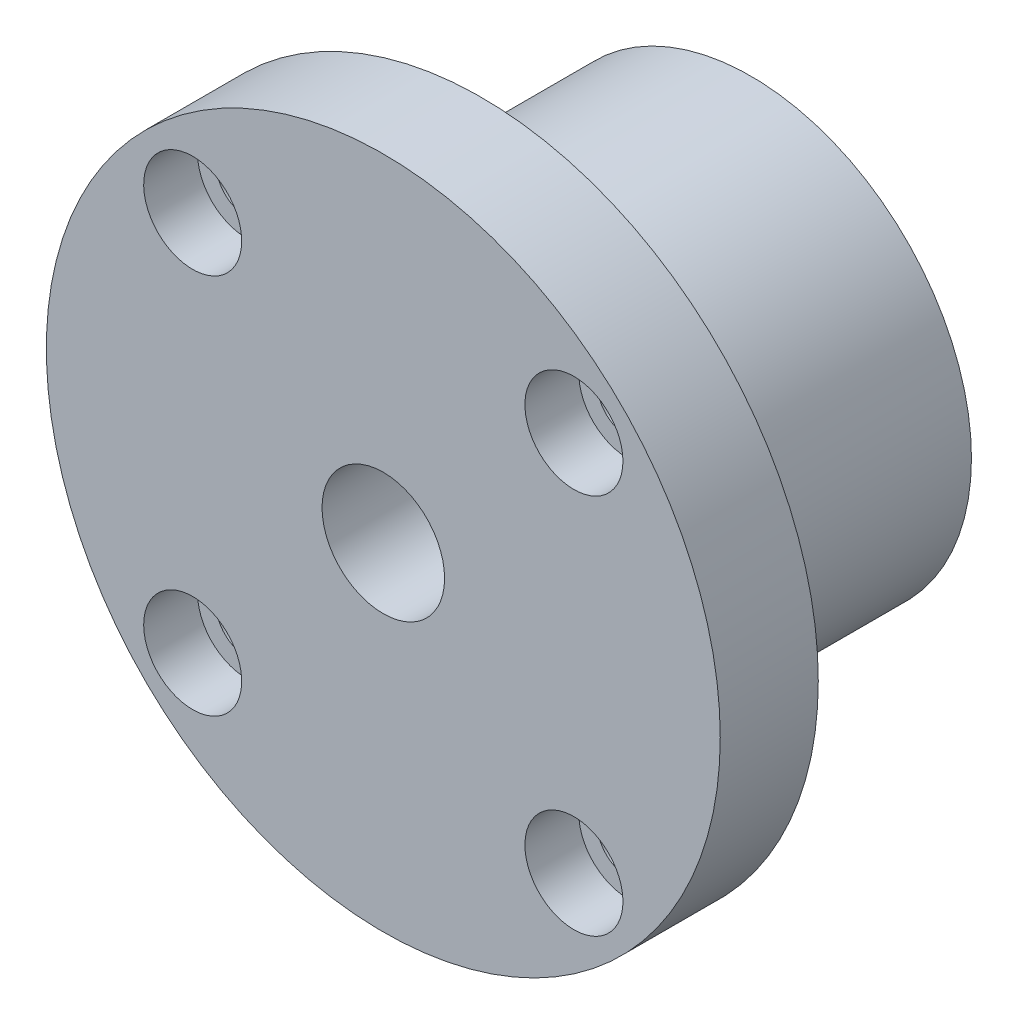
ISO-10303-21;
HEADER;
FILE_DESCRIPTION(('STEP AP214'),'2;1');
FILE_NAME('part.step','',(''),(''),'','','');
FILE_SCHEMA(('AUTOMOTIVE_DESIGN { 1 0 10303 214 1 1 1 1 }'));
ENDSEC;
DATA;
#1=APPLICATION_CONTEXT('core data for automotive mechanical design processes');
#2=APPLICATION_PROTOCOL_DEFINITION('international standard','automotive_design',2000,#1);
#3=PRODUCT_CONTEXT('',#1,'mechanical');
#4=PRODUCT('Part','Part','',(#3));
#5=PRODUCT_RELATED_PRODUCT_CATEGORY('part','',(#4));
#6=PRODUCT_DEFINITION_FORMATION('','',#4);
#7=PRODUCT_DEFINITION_CONTEXT('part definition',#1,'design');
#8=PRODUCT_DEFINITION('design','',#6,#7);
#9=PRODUCT_DEFINITION_SHAPE('','',#8);
#10=(LENGTH_UNIT() NAMED_UNIT(*) SI_UNIT(.MILLI.,.METRE.));
#11=(NAMED_UNIT(*) PLANE_ANGLE_UNIT() SI_UNIT($,.RADIAN.));
#12=(NAMED_UNIT(*) SI_UNIT($,.STERADIAN.) SOLID_ANGLE_UNIT());
#13=UNCERTAINTY_MEASURE_WITH_UNIT(LENGTH_MEASURE(1.E-05),#10,'distance_accuracy_value','');
#14=(GEOMETRIC_REPRESENTATION_CONTEXT(3) GLOBAL_UNCERTAINTY_ASSIGNED_CONTEXT((#13)) GLOBAL_UNIT_ASSIGNED_CONTEXT((#10,
#11,#12)) REPRESENTATION_CONTEXT('',''));
#15=CARTESIAN_POINT('',(0.,0.,0.));
#16=DIRECTION('',(0.,0.,1.));
#17=DIRECTION('',(1.,0.,0.));
#18=AXIS2_PLACEMENT_3D('',#15,#16,#17);
#19=CARTESIAN_POINT('',(0.,0.,0.));
#20=DIRECTION('',(0.,0.,1.));
#21=DIRECTION('',(1.,0.,0.));
#22=AXIS2_PLACEMENT_3D('',#19,#20,#21);
#23=PLANE('',#22);
#24=CARTESIAN_POINT('',(0.,0.,0.));
#25=DIRECTION('',(0.,0.,1.));
#26=DIRECTION('',(1.,0.,0.));
#27=AXIS2_PLACEMENT_3D('',#24,#25,#26);
#28=CIRCLE('',#27,27.5);
#29=CARTESIAN_POINT('',(27.5,0.,0.));
#30=VERTEX_POINT('',#29);
#31=EDGE_CURVE('E25',#30,#30,#28,.T.);
#32=ORIENTED_EDGE('',*,*,#31,.F.);
#33=EDGE_LOOP('',(#32));
#34=FACE_BOUND('',#33,.T.);
#35=CARTESIAN_POINT('',(15.556349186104,15.5563491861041,0.));
#36=DIRECTION('',(0.,0.,1.));
#37=DIRECTION('',(1.,0.,0.));
#38=AXIS2_PLACEMENT_3D('',#35,#36,#37);
#39=CIRCLE('',#38,2.5);
#40=CARTESIAN_POINT('',(18.056349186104,15.5563491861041,0.));
#41=VERTEX_POINT('',#40);
#42=EDGE_CURVE('E67',#41,#41,#39,.T.);
#43=ORIENTED_EDGE('',*,*,#42,.T.);
#44=EDGE_LOOP('',(#43));
#45=FACE_BOUND('',#44,.T.);
#46=CARTESIAN_POINT('',(15.556349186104,-15.556349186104,0.));
#47=DIRECTION('',(0.,0.,1.));
#48=DIRECTION('',(0.,-1.,0.));
#49=AXIS2_PLACEMENT_3D('',#46,#47,#48);
#50=CIRCLE('',#49,2.5);
#51=CARTESIAN_POINT('',(15.556349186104,-18.056349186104,0.));
#52=VERTEX_POINT('',#51);
#53=EDGE_CURVE('E57',#52,#52,#50,.T.);
#54=ORIENTED_EDGE('',*,*,#53,.T.);
#55=EDGE_LOOP('',(#54));
#56=FACE_BOUND('',#55,.T.);
#57=CARTESIAN_POINT('',(-15.5563491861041,-15.556349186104,0.));
#58=DIRECTION('',(0.,0.,1.));
#59=DIRECTION('',(-1.,0.,0.));
#60=AXIS2_PLACEMENT_3D('',#57,#58,#59);
#61=CIRCLE('',#60,2.5);
#62=CARTESIAN_POINT('',(-18.0563491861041,-15.556349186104,0.));
#63=VERTEX_POINT('',#62);
#64=EDGE_CURVE('E54',#63,#63,#61,.T.);
#65=ORIENTED_EDGE('',*,*,#64,.T.);
#66=EDGE_LOOP('',(#65));
#67=FACE_BOUND('',#66,.T.);
#68=CARTESIAN_POINT('',(-15.556349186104,15.5563491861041,0.));
#69=DIRECTION('',(0.,0.,1.));
#70=DIRECTION('',(0.,1.,0.));
#71=AXIS2_PLACEMENT_3D('',#68,#69,#70);
#72=CIRCLE('',#71,2.5);
#73=CARTESIAN_POINT('',(-15.5563491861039,18.0563491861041,0.));
#74=VERTEX_POINT('',#73);
#75=EDGE_CURVE('E51',#74,#74,#72,.T.);
#76=ORIENTED_EDGE('',*,*,#75,.T.);
#77=EDGE_LOOP('',(#76));
#78=FACE_BOUND('',#77,.T.);
#79=CARTESIAN_POINT('',(0.,0.,0.));
#80=DIRECTION('',(0.,0.,1.));
#81=DIRECTION('',(1.,0.,0.));
#82=AXIS2_PLACEMENT_3D('',#79,#80,#81);
#83=CIRCLE('',#82,18.);
#84=CARTESIAN_POINT('',(18.,0.,0.));
#85=VERTEX_POINT('',#84);
#86=EDGE_CURVE('E8',#85,#85,#83,.F.);
#87=ORIENTED_EDGE('',*,*,#86,.F.);
#88=EDGE_LOOP('',(#87));
#89=FACE_BOUND('',#88,.T.);
#90=ADVANCED_FACE('F12',(#34,#45,#56,#67,#78,#89),#23,.F.);
#91=CARTESIAN_POINT('',(-15.556349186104,15.5563491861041,0.));
#92=DIRECTION('',(0.,0.,1.));
#93=DIRECTION('',(1.,0.,0.));
#94=AXIS2_PLACEMENT_3D('',#91,#92,#93);
#95=CYLINDRICAL_SURFACE('',#94,2.5);
#96=ORIENTED_EDGE('',*,*,#75,.F.);
#97=EDGE_LOOP('',(#96));
#98=FACE_BOUND('',#97,.T.);
#99=CARTESIAN_POINT('',(-15.556349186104,15.5563491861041,3.6));
#100=DIRECTION('',(0.,0.,1.));
#101=DIRECTION('',(1.,0.,0.));
#102=AXIS2_PLACEMENT_3D('',#99,#100,#101);
#103=CIRCLE('',#102,2.5);
#104=CARTESIAN_POINT('',(-13.056349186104,15.5563491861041,3.6));
#105=VERTEX_POINT('',#104);
#106=EDGE_CURVE('E16',#105,#105,#103,.F.);
#107=ORIENTED_EDGE('',*,*,#106,.F.);
#108=EDGE_LOOP('',(#107));
#109=FACE_BOUND('',#108,.T.);
#110=ADVANCED_FACE('F86',(#98,#109),#95,.F.);
#111=CARTESIAN_POINT('',(-15.5563491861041,-15.556349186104,0.));
#112=DIRECTION('',(0.,0.,1.));
#113=DIRECTION('',(1.,0.,0.));
#114=AXIS2_PLACEMENT_3D('',#111,#112,#113);
#115=CYLINDRICAL_SURFACE('',#114,2.5);
#116=ORIENTED_EDGE('',*,*,#64,.F.);
#117=EDGE_LOOP('',(#116));
#118=FACE_BOUND('',#117,.T.);
#119=CARTESIAN_POINT('',(-15.5563491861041,-15.556349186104,3.6));
#120=DIRECTION('',(0.,0.,1.));
#121=DIRECTION('',(1.,0.,0.));
#122=AXIS2_PLACEMENT_3D('',#119,#120,#121);
#123=CIRCLE('',#122,2.5);
#124=CARTESIAN_POINT('',(-13.0563491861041,-15.556349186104,3.6));
#125=VERTEX_POINT('',#124);
#126=EDGE_CURVE('E43',#125,#125,#123,.F.);
#127=ORIENTED_EDGE('',*,*,#126,.F.);
#128=EDGE_LOOP('',(#127));
#129=FACE_BOUND('',#128,.T.);
#130=ADVANCED_FACE('F83',(#118,#129),#115,.F.);
#131=CARTESIAN_POINT('',(15.556349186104,-15.556349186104,0.));
#132=DIRECTION('',(0.,0.,1.));
#133=DIRECTION('',(1.,0.,0.));
#134=AXIS2_PLACEMENT_3D('',#131,#132,#133);
#135=CYLINDRICAL_SURFACE('',#134,2.5);
#136=ORIENTED_EDGE('',*,*,#53,.F.);
#137=EDGE_LOOP('',(#136));
#138=FACE_BOUND('',#137,.T.);
#139=CARTESIAN_POINT('',(15.556349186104,-15.556349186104,3.6));
#140=DIRECTION('',(0.,0.,1.));
#141=DIRECTION('',(1.,0.,0.));
#142=AXIS2_PLACEMENT_3D('',#139,#140,#141);
#143=CIRCLE('',#142,2.5);
#144=CARTESIAN_POINT('',(18.056349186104,-15.556349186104,3.6));
#145=VERTEX_POINT('',#144);
#146=EDGE_CURVE('E50',#145,#145,#143,.F.);
#147=ORIENTED_EDGE('',*,*,#146,.F.);
#148=EDGE_LOOP('',(#147));
#149=FACE_BOUND('',#148,.T.);
#150=ADVANCED_FACE('F85',(#138,#149),#135,.F.);
#151=CARTESIAN_POINT('',(15.556349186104,15.5563491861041,0.));
#152=DIRECTION('',(0.,0.,1.));
#153=DIRECTION('',(1.,0.,0.));
#154=AXIS2_PLACEMENT_3D('',#151,#152,#153);
#155=CYLINDRICAL_SURFACE('',#154,2.5);
#156=ORIENTED_EDGE('',*,*,#42,.F.);
#157=EDGE_LOOP('',(#156));
#158=FACE_BOUND('',#157,.T.);
#159=CARTESIAN_POINT('',(15.556349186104,15.5563491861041,3.6));
#160=DIRECTION('',(0.,0.,1.));
#161=DIRECTION('',(1.,0.,0.));
#162=AXIS2_PLACEMENT_3D('',#159,#160,#161);
#163=CIRCLE('',#162,2.5);
#164=CARTESIAN_POINT('',(18.056349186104,15.5563491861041,3.6));
#165=VERTEX_POINT('',#164);
#166=EDGE_CURVE('E66',#165,#165,#163,.F.);
#167=ORIENTED_EDGE('',*,*,#166,.F.);
#168=EDGE_LOOP('',(#167));
#169=FACE_BOUND('',#168,.T.);
#170=ADVANCED_FACE('F94',(#158,#169),#155,.F.);
#171=CARTESIAN_POINT('',(0.,0.,8.));
#172=DIRECTION('',(0.,0.,1.));
#173=DIRECTION('',(1.,0.,0.));
#174=AXIS2_PLACEMENT_3D('',#171,#172,#173);
#175=PLANE('',#174);
#176=CARTESIAN_POINT('',(-15.5563491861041,-15.556349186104,8.));
#177=DIRECTION('',(0.,0.,1.));
#178=DIRECTION('',(-1.,0.,0.));
#179=AXIS2_PLACEMENT_3D('',#176,#177,#178);
#180=CIRCLE('',#179,4.);
#181=CARTESIAN_POINT('',(-19.5563491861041,-15.556349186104,8.));
#182=VERTEX_POINT('',#181);
#183=EDGE_CURVE('E37',#182,#182,#180,.T.);
#184=ORIENTED_EDGE('',*,*,#183,.F.);
#185=EDGE_LOOP('',(#184));
#186=FACE_BOUND('',#185,.T.);
#187=CARTESIAN_POINT('',(-15.556349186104,15.5563491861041,8.));
#188=DIRECTION('',(0.,0.,1.));
#189=DIRECTION('',(0.,1.,0.));
#190=AXIS2_PLACEMENT_3D('',#187,#188,#189);
#191=CIRCLE('',#190,4.);
#192=CARTESIAN_POINT('',(-15.5563491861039,19.5563491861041,8.));
#193=VERTEX_POINT('',#192);
#194=EDGE_CURVE('E31',#193,#193,#191,.T.);
#195=ORIENTED_EDGE('',*,*,#194,.F.);
#196=EDGE_LOOP('',(#195));
#197=FACE_BOUND('',#196,.T.);
#198=CARTESIAN_POINT('',(15.556349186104,15.5563491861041,8.));
#199=DIRECTION('',(0.,0.,1.));
#200=DIRECTION('',(1.,0.,0.));
#201=AXIS2_PLACEMENT_3D('',#198,#199,#200);
#202=CIRCLE('',#201,4.);
#203=CARTESIAN_POINT('',(19.556349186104,15.5563491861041,8.));
#204=VERTEX_POINT('',#203);
#205=EDGE_CURVE('E60',#204,#204,#202,.T.);
#206=ORIENTED_EDGE('',*,*,#205,.F.);
#207=EDGE_LOOP('',(#206));
#208=FACE_BOUND('',#207,.T.);
#209=CARTESIAN_POINT('',(15.556349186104,-15.556349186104,8.));
#210=DIRECTION('',(0.,0.,1.));
#211=DIRECTION('',(0.,-1.,0.));
#212=AXIS2_PLACEMENT_3D('',#209,#210,#211);
#213=CIRCLE('',#212,4.);
#214=CARTESIAN_POINT('',(15.556349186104,-19.556349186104,8.));
#215=VERTEX_POINT('',#214);
#216=EDGE_CURVE('E44',#215,#215,#213,.T.);
#217=ORIENTED_EDGE('',*,*,#216,.F.);
#218=EDGE_LOOP('',(#217));
#219=FACE_BOUND('',#218,.T.);
#220=CARTESIAN_POINT('',(0.,0.,8.));
#221=DIRECTION('',(0.,0.,1.));
#222=DIRECTION('',(1.,0.,0.));
#223=AXIS2_PLACEMENT_3D('',#220,#221,#222);
#224=CIRCLE('',#223,5.);
#225=CARTESIAN_POINT('',(5.,0.,8.));
#226=VERTEX_POINT('',#225);
#227=EDGE_CURVE('E70',#226,#226,#224,.T.);
#228=ORIENTED_EDGE('',*,*,#227,.F.);
#229=EDGE_LOOP('',(#228));
#230=FACE_BOUND('',#229,.T.);
#231=CARTESIAN_POINT('',(0.,0.,8.));
#232=DIRECTION('',(0.,0.,1.));
#233=DIRECTION('',(1.,0.,0.));
#234=AXIS2_PLACEMENT_3D('',#231,#232,#233);
#235=CIRCLE('',#234,27.5);
#236=CARTESIAN_POINT('',(27.5,0.,8.));
#237=VERTEX_POINT('',#236);
#238=EDGE_CURVE('E20',#237,#237,#235,.T.);
#239=ORIENTED_EDGE('',*,*,#238,.T.);
#240=EDGE_LOOP('',(#239));
#241=FACE_BOUND('',#240,.T.);
#242=ADVANCED_FACE('F110',(#186,#197,#208,#219,#230,#241),#175,.T.);
#243=CARTESIAN_POINT('',(0.,0.,8.));
#244=DIRECTION('',(0.,0.,-1.));
#245=DIRECTION('',(-1.,0.,0.));
#246=AXIS2_PLACEMENT_3D('',#243,#244,#245);
#247=CYLINDRICAL_SURFACE('',#246,27.5);
#248=ORIENTED_EDGE('',*,*,#238,.F.);
#249=EDGE_LOOP('',(#248));
#250=FACE_BOUND('',#249,.T.);
#251=ORIENTED_EDGE('',*,*,#31,.T.);
#252=EDGE_LOOP('',(#251));
#253=FACE_BOUND('',#252,.T.);
#254=ADVANCED_FACE('F14',(#250,#253),#247,.T.);
#255=CARTESIAN_POINT('',(0.,0.,8.));
#256=DIRECTION('',(0.,0.,-1.));
#257=DIRECTION('',(-1.,0.,0.));
#258=AXIS2_PLACEMENT_3D('',#255,#256,#257);
#259=CYLINDRICAL_SURFACE('',#258,5.);
#260=ORIENTED_EDGE('',*,*,#227,.T.);
#261=EDGE_LOOP('',(#260));
#262=FACE_BOUND('',#261,.T.);
#263=CARTESIAN_POINT('',(0.,0.,-22.));
#264=DIRECTION('',(0.,0.,-1.));
#265=DIRECTION('',(-1.,0.,0.));
#266=AXIS2_PLACEMENT_3D('',#263,#264,#265);
#267=CIRCLE('',#266,5.);
#268=CARTESIAN_POINT('',(-5.,0.,-22.));
#269=VERTEX_POINT('',#268);
#270=EDGE_CURVE('E137',#269,#269,#267,.T.);
#271=ORIENTED_EDGE('',*,*,#270,.T.);
#272=EDGE_LOOP('',(#271));
#273=FACE_BOUND('',#272,.T.);
#274=ADVANCED_FACE('F108',(#262,#273),#259,.F.);
#275=CARTESIAN_POINT('',(15.556349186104,15.5563491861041,3.6));
#276=DIRECTION('',(0.,0.,1.));
#277=DIRECTION('',(1.,0.,0.));
#278=AXIS2_PLACEMENT_3D('',#275,#276,#277);
#279=PLANE('',#278);
#280=CARTESIAN_POINT('',(15.556349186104,15.5563491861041,3.6));
#281=DIRECTION('',(0.,0.,1.));
#282=DIRECTION('',(1.,0.,0.));
#283=AXIS2_PLACEMENT_3D('',#280,#281,#282);
#284=CIRCLE('',#283,4.);
#285=CARTESIAN_POINT('',(19.556349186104,15.5563491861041,3.6));
#286=VERTEX_POINT('',#285);
#287=EDGE_CURVE('E63',#286,#286,#284,.T.);
#288=ORIENTED_EDGE('',*,*,#287,.T.);
#289=EDGE_LOOP('',(#288));
#290=FACE_BOUND('',#289,.T.);
#291=ORIENTED_EDGE('',*,*,#166,.T.);
#292=EDGE_LOOP('',(#291));
#293=FACE_BOUND('',#292,.T.);
#294=ADVANCED_FACE('F134',(#290,#293),#279,.T.);
#295=CARTESIAN_POINT('',(15.556349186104,15.5563491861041,3.6));
#296=DIRECTION('',(0.,0.,1.));
#297=DIRECTION('',(1.,0.,0.));
#298=AXIS2_PLACEMENT_3D('',#295,#296,#297);
#299=CYLINDRICAL_SURFACE('',#298,4.);
#300=ORIENTED_EDGE('',*,*,#205,.T.);
#301=EDGE_LOOP('',(#300));
#302=FACE_BOUND('',#301,.T.);
#303=ORIENTED_EDGE('',*,*,#287,.F.);
#304=EDGE_LOOP('',(#303));
#305=FACE_BOUND('',#304,.T.);
#306=ADVANCED_FACE('F171',(#302,#305),#299,.F.);
#307=CARTESIAN_POINT('',(15.556349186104,-15.556349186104,3.6));
#308=DIRECTION('',(0.,0.,1.));
#309=DIRECTION('',(0.,-1.,0.));
#310=AXIS2_PLACEMENT_3D('',#307,#308,#309);
#311=PLANE('',#310);
#312=CARTESIAN_POINT('',(15.556349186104,-15.556349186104,3.6));
#313=DIRECTION('',(0.,0.,1.));
#314=DIRECTION('',(0.,-1.,0.));
#315=AXIS2_PLACEMENT_3D('',#312,#313,#314);
#316=CIRCLE('',#315,4.);
#317=CARTESIAN_POINT('',(15.556349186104,-19.556349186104,3.6));
#318=VERTEX_POINT('',#317);
#319=EDGE_CURVE('E47',#318,#318,#316,.T.);
#320=ORIENTED_EDGE('',*,*,#319,.T.);
#321=EDGE_LOOP('',(#320));
#322=FACE_BOUND('',#321,.T.);
#323=ORIENTED_EDGE('',*,*,#146,.T.);
#324=EDGE_LOOP('',(#323));
#325=FACE_BOUND('',#324,.T.);
#326=ADVANCED_FACE('F168',(#322,#325),#311,.T.);
#327=CARTESIAN_POINT('',(15.556349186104,-15.556349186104,3.6));
#328=DIRECTION('',(0.,0.,1.));
#329=DIRECTION('',(1.,0.,0.));
#330=AXIS2_PLACEMENT_3D('',#327,#328,#329);
#331=CYLINDRICAL_SURFACE('',#330,4.);
#332=ORIENTED_EDGE('',*,*,#216,.T.);
#333=EDGE_LOOP('',(#332));
#334=FACE_BOUND('',#333,.T.);
#335=ORIENTED_EDGE('',*,*,#319,.F.);
#336=EDGE_LOOP('',(#335));
#337=FACE_BOUND('',#336,.T.);
#338=ADVANCED_FACE('F163',(#334,#337),#331,.F.);
#339=CARTESIAN_POINT('',(-15.5563491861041,-15.556349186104,3.6));
#340=DIRECTION('',(0.,0.,1.));
#341=DIRECTION('',(-1.,0.,0.));
#342=AXIS2_PLACEMENT_3D('',#339,#340,#341);
#343=PLANE('',#342);
#344=CARTESIAN_POINT('',(-15.5563491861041,-15.556349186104,3.6));
#345=DIRECTION('',(0.,0.,1.));
#346=DIRECTION('',(-1.,0.,0.));
#347=AXIS2_PLACEMENT_3D('',#344,#345,#346);
#348=CIRCLE('',#347,4.);
#349=CARTESIAN_POINT('',(-19.5563491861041,-15.556349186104,3.6));
#350=VERTEX_POINT('',#349);
#351=EDGE_CURVE('E40',#350,#350,#348,.T.);
#352=ORIENTED_EDGE('',*,*,#351,.T.);
#353=EDGE_LOOP('',(#352));
#354=FACE_BOUND('',#353,.T.);
#355=ORIENTED_EDGE('',*,*,#126,.T.);
#356=EDGE_LOOP('',(#355));
#357=FACE_BOUND('',#356,.T.);
#358=ADVANCED_FACE('F81',(#354,#357),#343,.T.);
#359=CARTESIAN_POINT('',(-15.5563491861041,-15.556349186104,3.6));
#360=DIRECTION('',(0.,0.,1.));
#361=DIRECTION('',(1.,0.,0.));
#362=AXIS2_PLACEMENT_3D('',#359,#360,#361);
#363=CYLINDRICAL_SURFACE('',#362,4.);
#364=ORIENTED_EDGE('',*,*,#183,.T.);
#365=EDGE_LOOP('',(#364));
#366=FACE_BOUND('',#365,.T.);
#367=ORIENTED_EDGE('',*,*,#351,.F.);
#368=EDGE_LOOP('',(#367));
#369=FACE_BOUND('',#368,.T.);
#370=ADVANCED_FACE('F158',(#366,#369),#363,.F.);
#371=CARTESIAN_POINT('',(-15.556349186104,15.5563491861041,3.6));
#372=DIRECTION('',(0.,0.,1.));
#373=DIRECTION('',(0.,1.,0.));
#374=AXIS2_PLACEMENT_3D('',#371,#372,#373);
#375=PLANE('',#374);
#376=CARTESIAN_POINT('',(-15.556349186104,15.5563491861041,3.6));
#377=DIRECTION('',(0.,0.,1.));
#378=DIRECTION('',(0.,1.,0.));
#379=AXIS2_PLACEMENT_3D('',#376,#377,#378);
#380=CIRCLE('',#379,4.);
#381=CARTESIAN_POINT('',(-15.5563491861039,19.5563491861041,3.6));
#382=VERTEX_POINT('',#381);
#383=EDGE_CURVE('E34',#382,#382,#380,.T.);
#384=ORIENTED_EDGE('',*,*,#383,.T.);
#385=EDGE_LOOP('',(#384));
#386=FACE_BOUND('',#385,.T.);
#387=ORIENTED_EDGE('',*,*,#106,.T.);
#388=EDGE_LOOP('',(#387));
#389=FACE_BOUND('',#388,.T.);
#390=ADVANCED_FACE('F153',(#386,#389),#375,.T.);
#391=CARTESIAN_POINT('',(-15.556349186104,15.5563491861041,3.6));
#392=DIRECTION('',(0.,0.,1.));
#393=DIRECTION('',(1.,0.,0.));
#394=AXIS2_PLACEMENT_3D('',#391,#392,#393);
#395=CYLINDRICAL_SURFACE('',#394,4.);
#396=ORIENTED_EDGE('',*,*,#194,.T.);
#397=EDGE_LOOP('',(#396));
#398=FACE_BOUND('',#397,.T.);
#399=ORIENTED_EDGE('',*,*,#383,.F.);
#400=EDGE_LOOP('',(#399));
#401=FACE_BOUND('',#400,.T.);
#402=ADVANCED_FACE('F146',(#398,#401),#395,.F.);
#403=CARTESIAN_POINT('',(0.,0.,-22.));
#404=DIRECTION('',(0.,0.,1.));
#405=DIRECTION('',(1.,0.,0.));
#406=AXIS2_PLACEMENT_3D('',#403,#404,#405);
#407=CYLINDRICAL_SURFACE('',#406,18.);
#408=CARTESIAN_POINT('',(0.,0.,-22.));
#409=DIRECTION('',(0.,0.,-1.));
#410=DIRECTION('',(-1.,0.,0.));
#411=AXIS2_PLACEMENT_3D('',#408,#409,#410);
#412=CIRCLE('',#411,18.);
#413=CARTESIAN_POINT('',(-18.,0.,-22.));
#414=VERTEX_POINT('',#413);
#415=EDGE_CURVE('E29',#414,#414,#412,.T.);
#416=ORIENTED_EDGE('',*,*,#415,.F.);
#417=EDGE_LOOP('',(#416));
#418=FACE_BOUND('',#417,.T.);
#419=ORIENTED_EDGE('',*,*,#86,.T.);
#420=EDGE_LOOP('',(#419));
#421=FACE_BOUND('',#420,.T.);
#422=ADVANCED_FACE('F144',(#418,#421),#407,.T.);
#423=CARTESIAN_POINT('',(0.,0.,-22.));
#424=DIRECTION('',(0.,0.,-1.));
#425=DIRECTION('',(-1.,0.,0.));
#426=AXIS2_PLACEMENT_3D('',#423,#424,#425);
#427=PLANE('',#426);
#428=ORIENTED_EDGE('',*,*,#415,.T.);
#429=EDGE_LOOP('',(#428));
#430=FACE_BOUND('',#429,.T.);
#431=ORIENTED_EDGE('',*,*,#270,.F.);
#432=EDGE_LOOP('',(#431));
#433=FACE_BOUND('',#432,.T.);
#434=ADVANCED_FACE('F142',(#430,#433),#427,.T.);
#435=CLOSED_SHELL('',(#90,#110,#130,#150,#170,#242,#254,#274,#294,#306,#326,#338,#358,#370,#390,
#402,#422,#434));
#436=MANIFOLD_SOLID_BREP('B1',#435);
#437=ADVANCED_BREP_SHAPE_REPRESENTATION('',(#18,#436),#14);
#438=SHAPE_DEFINITION_REPRESENTATION(#9,#437);
ENDSEC;
END-ISO-10303-21;
